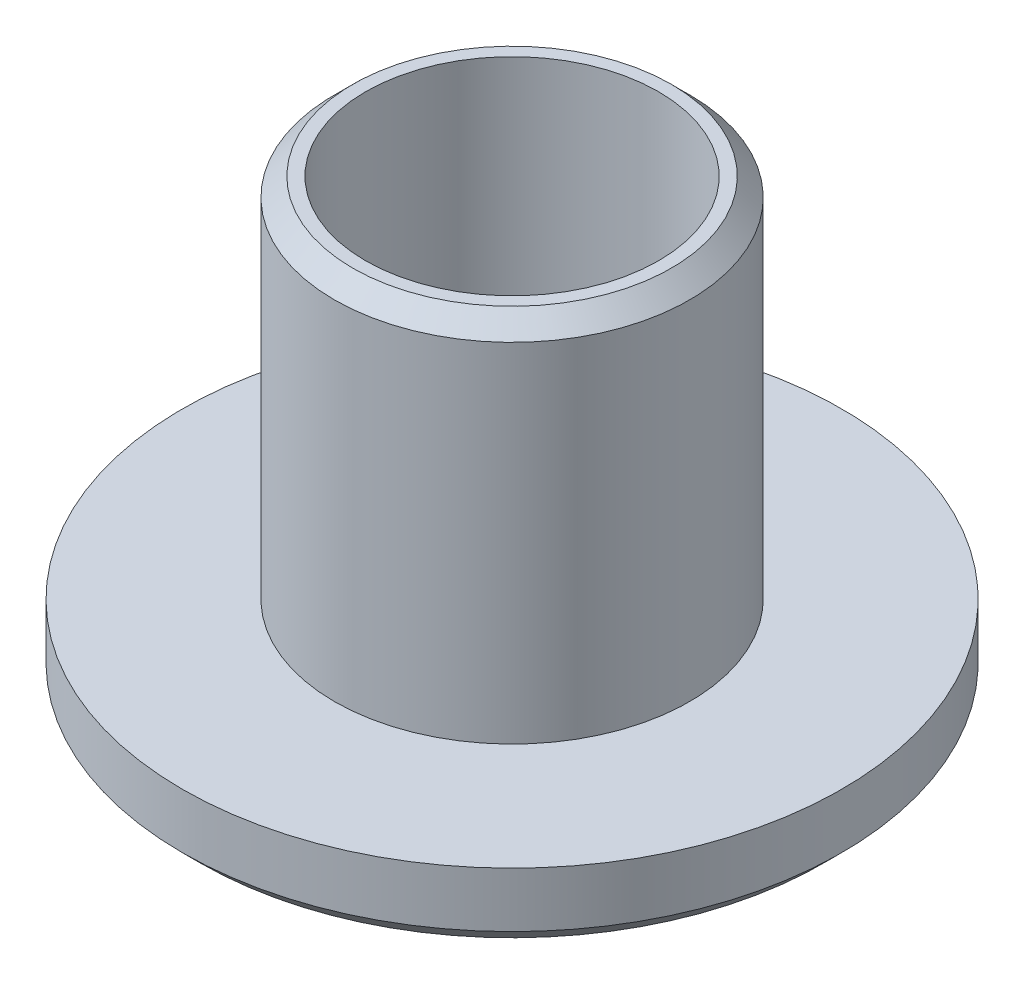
from build123d import *

# Parameters (mm, degrees)
SKIZZE1_R                       = 9
SKIZZE1_R_2                     = 4
AUFSATZ_LINEAR_AUSTRAGEN1_DEPTH = 2
SKIZZE2_R                       = 4.85
SKIZZE2_R_2                     = 4
AUFSATZ_LINEAR_AUSTRAGEN2_DEPTH = 10
FASE1_SIZE                      = 0.5


with BuildPart() as part:
    # Skizze1 → Aufsatz-Linear austragen1 (new body)
    with BuildSketch(Plane(origin=(0, 0, 0), x_dir=(1, 0, 0), z_dir=(0, 1, 0))):
        with Locations(Location((0, 0, 0), (0, 0, 270))):
            Circle(SKIZZE1_R)
        with Locations(Location((0, 0, 0), (0, 0, 270))):
            Circle(SKIZZE1_R_2, mode=Mode.SUBTRACT)
    extrude(amount=AUFSATZ_LINEAR_AUSTRAGEN1_DEPTH)

    # Skizze2 → Aufsatz-Linear austragen2 (add)
    with BuildSketch(Plane(origin=(0, 2, 0), x_dir=(1, 0, 0), z_dir=(0, 1, 0))):
        with Locations(Location((0, 0, 0), (0, 0, 270))):
            Circle(SKIZZE2_R)
        with Locations(Location((0, 0, 0), (0, 0, 270))):
            Circle(SKIZZE2_R_2, mode=Mode.SUBTRACT)
    extrude(amount=AUFSATZ_LINEAR_AUSTRAGEN2_DEPTH)

    # Fase1
    fase1_edges = [part.edges().sort_by_distance(p)[0] for p in [
        (0, 12, -4.85),
        (0, 0, -9),
    ]]
    chamfer(fase1_edges, length=FASE1_SIZE)


solid = part.part
